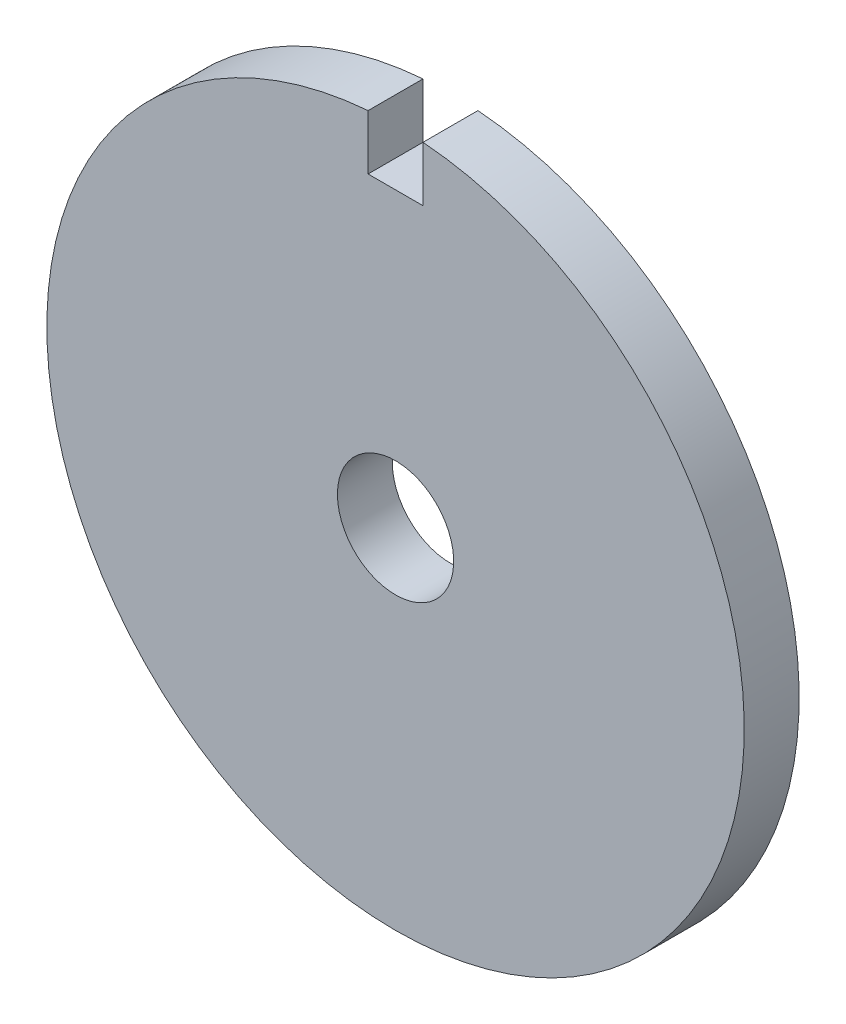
ISO-10303-21;
HEADER;
FILE_DESCRIPTION(('STEP AP214'),'2;1');
FILE_NAME('part.step','',(''),(''),'','','');
FILE_SCHEMA(('AUTOMOTIVE_DESIGN { 1 0 10303 214 1 1 1 1 }'));
ENDSEC;
DATA;
#1=APPLICATION_CONTEXT('core data for automotive mechanical design processes');
#2=APPLICATION_PROTOCOL_DEFINITION('international standard','automotive_design',2000,#1);
#3=PRODUCT_CONTEXT('',#1,'mechanical');
#4=PRODUCT('Part','Part','',(#3));
#5=PRODUCT_RELATED_PRODUCT_CATEGORY('part','',(#4));
#6=PRODUCT_DEFINITION_FORMATION('','',#4);
#7=PRODUCT_DEFINITION_CONTEXT('part definition',#1,'design');
#8=PRODUCT_DEFINITION('design','',#6,#7);
#9=PRODUCT_DEFINITION_SHAPE('','',#8);
#10=(LENGTH_UNIT() NAMED_UNIT(*) SI_UNIT(.MILLI.,.METRE.));
#11=(NAMED_UNIT(*) PLANE_ANGLE_UNIT() SI_UNIT($,.RADIAN.));
#12=(NAMED_UNIT(*) SI_UNIT($,.STERADIAN.) SOLID_ANGLE_UNIT());
#13=UNCERTAINTY_MEASURE_WITH_UNIT(LENGTH_MEASURE(1.E-05),#10,'distance_accuracy_value','');
#14=(GEOMETRIC_REPRESENTATION_CONTEXT(3) GLOBAL_UNCERTAINTY_ASSIGNED_CONTEXT((#13)) GLOBAL_UNIT_ASSIGNED_CONTEXT((#10,
#11,#12)) REPRESENTATION_CONTEXT('',''));
#15=CARTESIAN_POINT('',(0.,0.,0.));
#16=DIRECTION('',(0.,0.,1.));
#17=DIRECTION('',(1.,0.,0.));
#18=AXIS2_PLACEMENT_3D('',#15,#16,#17);
#19=CARTESIAN_POINT('',(0.,0.,2.99974));
#20=DIRECTION('',(0.,0.,1.));
#21=DIRECTION('',(1.,0.,0.));
#22=AXIS2_PLACEMENT_3D('',#19,#20,#21);
#23=PLANE('',#22);
#24=CARTESIAN_POINT('',(0.,0.,2.99974));
#25=DIRECTION('',(0.,0.,1.));
#26=DIRECTION('',(1.,0.,0.));
#27=AXIS2_PLACEMENT_3D('',#24,#25,#26);
#28=CIRCLE('',#27,3.175);
#29=CARTESIAN_POINT('',(-3.175,0.,2.99974));
#30=VERTEX_POINT('',#29);
#31=EDGE_CURVE('E58',#30,#30,#28,.T.);
#32=ORIENTED_EDGE('',*,*,#31,.F.);
#33=EDGE_LOOP('',(#32));
#34=FACE_BOUND('',#33,.T.);
#35=DIRECTION('',(-1.,0.,0.));
#36=VECTOR('',#35,1.);
#37=CARTESIAN_POINT('',(0.,15.990852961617,2.99974));
#38=LINE('',#37,#36);
#39=CARTESIAN_POINT('',(1.500000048,15.990852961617,2.99974));
#40=VERTEX_POINT('',#39);
#41=CARTESIAN_POINT('',(-1.500000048,15.990852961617,2.99974));
#42=VERTEX_POINT('',#41);
#43=EDGE_CURVE('E102',#40,#42,#38,.T.);
#44=ORIENTED_EDGE('',*,*,#43,.T.);
#45=DIRECTION('',(0.,-1.,0.));
#46=VECTOR('',#45,1.);
#47=CARTESIAN_POINT('',(-1.500000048,0.,2.99974));
#48=LINE('',#47,#46);
#49=CARTESIAN_POINT('',(-1.50000004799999,18.990853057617,2.99974));
#50=VERTEX_POINT('',#49);
#51=EDGE_CURVE('E93',#50,#42,#48,.T.);
#52=ORIENTED_EDGE('',*,*,#51,.F.);
#53=CARTESIAN_POINT('',(0.,0.,2.99974));
#54=DIRECTION('',(0.,0.,1.));
#55=DIRECTION('',(1.,0.,0.));
#56=AXIS2_PLACEMENT_3D('',#53,#54,#55);
#57=CIRCLE('',#56,19.05);
#58=CARTESIAN_POINT('',(1.500000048,18.990853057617,2.99974));
#59=VERTEX_POINT('',#58);
#60=EDGE_CURVE('E107',#50,#59,#57,.T.);
#61=ORIENTED_EDGE('',*,*,#60,.T.);
#62=DIRECTION('',(0.,-1.,0.));
#63=VECTOR('',#62,1.);
#64=CARTESIAN_POINT('',(1.500000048,0.,2.99974));
#65=LINE('',#64,#63);
#66=EDGE_CURVE('E65',#59,#40,#65,.T.);
#67=ORIENTED_EDGE('',*,*,#66,.T.);
#68=EDGE_LOOP('',(#44,#52,#61,#67));
#69=FACE_BOUND('',#68,.T.);
#70=ADVANCED_FACE('F49',(#34,#69),#23,.T.);
#71=CARTESIAN_POINT('',(0.,0.,0.));
#72=DIRECTION('',(0.,0.,1.));
#73=DIRECTION('',(1.,0.,0.));
#74=AXIS2_PLACEMENT_3D('',#71,#72,#73);
#75=PLANE('',#74);
#76=CARTESIAN_POINT('',(0.,0.,0.));
#77=DIRECTION('',(0.,0.,1.));
#78=DIRECTION('',(1.,0.,0.));
#79=AXIS2_PLACEMENT_3D('',#76,#77,#78);
#80=CIRCLE('',#79,3.175);
#81=CARTESIAN_POINT('',(-3.175,0.,0.));
#82=VERTEX_POINT('',#81);
#83=EDGE_CURVE('E113',#82,#82,#80,.T.);
#84=ORIENTED_EDGE('',*,*,#83,.T.);
#85=EDGE_LOOP('',(#84));
#86=FACE_BOUND('',#85,.T.);
#87=DIRECTION('',(0.,1.,0.));
#88=VECTOR('',#87,1.);
#89=CARTESIAN_POINT('',(-1.500000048,0.,0.));
#90=LINE('',#89,#88);
#91=CARTESIAN_POINT('',(-1.500000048,15.990852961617,0.));
#92=VERTEX_POINT('',#91);
#93=CARTESIAN_POINT('',(-1.50000004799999,18.990853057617,0.));
#94=VERTEX_POINT('',#93);
#95=EDGE_CURVE('E95',#92,#94,#90,.T.);
#96=ORIENTED_EDGE('',*,*,#95,.F.);
#97=DIRECTION('',(1.,0.,0.));
#98=VECTOR('',#97,1.);
#99=CARTESIAN_POINT('',(0.,15.990852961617,0.));
#100=LINE('',#99,#98);
#101=CARTESIAN_POINT('',(1.500000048,15.990852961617,0.));
#102=VERTEX_POINT('',#101);
#103=EDGE_CURVE('E11',#92,#102,#100,.T.);
#104=ORIENTED_EDGE('',*,*,#103,.T.);
#105=DIRECTION('',(0.,1.,0.));
#106=VECTOR('',#105,1.);
#107=CARTESIAN_POINT('',(1.500000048,0.,0.));
#108=LINE('',#107,#106);
#109=CARTESIAN_POINT('',(1.50000004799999,18.990853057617,0.));
#110=VERTEX_POINT('',#109);
#111=EDGE_CURVE('E158',#102,#110,#108,.T.);
#112=ORIENTED_EDGE('',*,*,#111,.T.);
#113=CARTESIAN_POINT('',(0.,0.,0.));
#114=DIRECTION('',(0.,0.,1.));
#115=DIRECTION('',(1.,0.,0.));
#116=AXIS2_PLACEMENT_3D('',#113,#114,#115);
#117=CIRCLE('',#116,19.05);
#118=EDGE_CURVE('E114',#94,#110,#117,.T.);
#119=ORIENTED_EDGE('',*,*,#118,.F.);
#120=EDGE_LOOP('',(#96,#104,#112,#119));
#121=FACE_BOUND('',#120,.T.);
#122=ADVANCED_FACE('F137',(#86,#121),#75,.F.);
#123=CARTESIAN_POINT('',(0.,0.,56.8812767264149));
#124=DIRECTION('',(0.,0.,-1.));
#125=DIRECTION('',(-1.,0.,0.));
#126=AXIS2_PLACEMENT_3D('',#123,#124,#125);
#127=CYLINDRICAL_SURFACE('',#126,19.05);
#128=DIRECTION('',(0.,0.,-1.));
#129=VECTOR('',#128,1.);
#130=CARTESIAN_POINT('',(-1.50000004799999,18.990853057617,2.99974));
#131=LINE('',#130,#129);
#132=EDGE_CURVE('E90',#50,#94,#131,.T.);
#133=ORIENTED_EDGE('',*,*,#132,.T.);
#134=ORIENTED_EDGE('',*,*,#118,.T.);
#135=DIRECTION('',(0.,0.,-1.));
#136=VECTOR('',#135,1.);
#137=CARTESIAN_POINT('',(1.50000004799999,18.990853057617,2.99974));
#138=LINE('',#137,#136);
#139=EDGE_CURVE('E101',#59,#110,#138,.T.);
#140=ORIENTED_EDGE('',*,*,#139,.F.);
#141=ORIENTED_EDGE('',*,*,#60,.F.);
#142=EDGE_LOOP('',(#133,#134,#140,#141));
#143=FACE_BOUND('',#142,.T.);
#144=ADVANCED_FACE('F111',(#143),#127,.T.);
#145=CARTESIAN_POINT('',(0.,0.,2.99974));
#146=DIRECTION('',(0.,0.,-1.));
#147=DIRECTION('',(-1.,0.,0.));
#148=AXIS2_PLACEMENT_3D('',#145,#146,#147);
#149=CYLINDRICAL_SURFACE('',#148,3.175);
#150=CARTESIAN_POINT('',(-3.175,0.,2.99974));
#151=CARTESIAN_POINT('',(-3.175,0.,2.96849270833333));
#152=CARTESIAN_POINT('',(-3.175,0.,2.93724541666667));
#153=CARTESIAN_POINT('',(-3.175,0.,2.87475083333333));
#154=CARTESIAN_POINT('',(-3.175,0.,2.84350354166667));
#155=CARTESIAN_POINT('',(-3.175,0.,2.78100895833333));
#156=CARTESIAN_POINT('',(-3.175,0.,2.74976166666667));
#157=CARTESIAN_POINT('',(-3.175,0.,2.68726708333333));
#158=CARTESIAN_POINT('',(-3.175,0.,2.65601979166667));
#159=CARTESIAN_POINT('',(-3.175,0.,2.59352520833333));
#160=CARTESIAN_POINT('',(-3.175,0.,2.56227791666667));
#161=CARTESIAN_POINT('',(-3.175,0.,2.49978333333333));
#162=CARTESIAN_POINT('',(-3.175,0.,2.46853604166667));
#163=CARTESIAN_POINT('',(-3.175,0.,2.40604145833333));
#164=CARTESIAN_POINT('',(-3.175,0.,2.37479416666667));
#165=CARTESIAN_POINT('',(-3.175,0.,2.31229958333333));
#166=CARTESIAN_POINT('',(-3.175,0.,2.28105229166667));
#167=CARTESIAN_POINT('',(-3.175,0.,2.21855770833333));
#168=CARTESIAN_POINT('',(-3.175,0.,2.18731041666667));
#169=CARTESIAN_POINT('',(-3.175,0.,2.12481583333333));
#170=CARTESIAN_POINT('',(-3.175,0.,2.09356854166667));
#171=CARTESIAN_POINT('',(-3.175,0.,2.03107395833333));
#172=CARTESIAN_POINT('',(-3.175,0.,1.99982666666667));
#173=CARTESIAN_POINT('',(-3.175,0.,1.93733208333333));
#174=CARTESIAN_POINT('',(-3.175,0.,1.90608479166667));
#175=CARTESIAN_POINT('',(-3.175,0.,1.84359020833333));
#176=CARTESIAN_POINT('',(-3.175,0.,1.81234291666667));
#177=CARTESIAN_POINT('',(-3.175,0.,1.74984833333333));
#178=CARTESIAN_POINT('',(-3.175,0.,1.71860104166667));
#179=CARTESIAN_POINT('',(-3.175,0.,1.65610645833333));
#180=CARTESIAN_POINT('',(-3.175,0.,1.62485916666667));
#181=CARTESIAN_POINT('',(-3.175,0.,1.56236458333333));
#182=CARTESIAN_POINT('',(-3.175,0.,1.53111729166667));
#183=CARTESIAN_POINT('',(-3.175,0.,1.46862270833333));
#184=CARTESIAN_POINT('',(-3.175,0.,1.43737541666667));
#185=CARTESIAN_POINT('',(-3.175,0.,1.37488083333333));
#186=CARTESIAN_POINT('',(-3.175,0.,1.34363354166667));
#187=CARTESIAN_POINT('',(-3.175,0.,1.28113895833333));
#188=CARTESIAN_POINT('',(-3.175,0.,1.24989166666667));
#189=CARTESIAN_POINT('',(-3.175,0.,1.18739708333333));
#190=CARTESIAN_POINT('',(-3.175,0.,1.15614979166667));
#191=CARTESIAN_POINT('',(-3.175,0.,1.09365520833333));
#192=CARTESIAN_POINT('',(-3.175,0.,1.06240791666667));
#193=CARTESIAN_POINT('',(-3.175,0.,0.999913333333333));
#194=CARTESIAN_POINT('',(-3.175,0.,0.968666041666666));
#195=CARTESIAN_POINT('',(-3.175,0.,0.906171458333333));
#196=CARTESIAN_POINT('',(-3.175,0.,0.874924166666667));
#197=CARTESIAN_POINT('',(-3.175,0.,0.812429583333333));
#198=CARTESIAN_POINT('',(-3.175,0.,0.781182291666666));
#199=CARTESIAN_POINT('',(-3.175,0.,0.718687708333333));
#200=CARTESIAN_POINT('',(-3.175,0.,0.687440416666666));
#201=CARTESIAN_POINT('',(-3.175,0.,0.624945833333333));
#202=CARTESIAN_POINT('',(-3.175,0.,0.593698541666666));
#203=CARTESIAN_POINT('',(-3.175,0.,0.531203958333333));
#204=CARTESIAN_POINT('',(-3.175,0.,0.499956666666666));
#205=CARTESIAN_POINT('',(-3.175,0.,0.437462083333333));
#206=CARTESIAN_POINT('',(-3.175,0.,0.406214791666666));
#207=CARTESIAN_POINT('',(-3.175,0.,0.343720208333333));
#208=CARTESIAN_POINT('',(-3.175,0.,0.312472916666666));
#209=CARTESIAN_POINT('',(-3.175,0.,0.249978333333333));
#210=CARTESIAN_POINT('',(-3.175,0.,0.218731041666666));
#211=CARTESIAN_POINT('',(-3.175,0.,0.156236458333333));
#212=CARTESIAN_POINT('',(-3.175,0.,0.124989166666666));
#213=CARTESIAN_POINT('',(-3.175,0.,0.0624945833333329));
#214=CARTESIAN_POINT('',(-3.175,0.,0.0312472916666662));
#215=CARTESIAN_POINT('',(-3.175,0.,0.));
#216=B_SPLINE_CURVE_WITH_KNOTS('',3,(#150,#151,#152,#153,#154,#155,#156,#157,#158,#159,#160,
#161,#162,#163,#164,#165,#166,#167,#168,#169,#170,#171,#172,#173,#174,#175,#176,#177,#178,#179,
#180,#181,#182,#183,#184,#185,#186,#187,#188,#189,#190,#191,#192,#193,#194,#195,#196,#197,#198,
#199,#200,#201,#202,#203,#204,#205,#206,#207,#208,#209,#210,#211,#212,#213,#214,#215),
.UNSPECIFIED.,.F.,.F.,(4,2,2,2,2,2,2,2,2,2,2,2,2,2,2,2,2,2,2,2,2,2,2,2,2,2,2,2,2,2,2,2,4),(0.,
0.0937418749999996,0.18748375,0.281225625,0.3749675,0.468709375,0.56245125,0.656193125,0.749935,
0.843676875,0.93741875,1.031160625,1.1249025,1.218644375,1.31238625,1.406128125,1.49987,
1.593611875,1.68735375,1.781095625,1.8748375,1.968579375,2.06232125,2.156063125,2.249805,
2.343546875,2.43728875,2.531030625,2.6247725,2.718514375,2.81225625,2.905998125,2.99974),.UNSPECIFIED.);
#217=EDGE_CURVE('BSEAM51',#30,#82,#216,.T.);
#218=ORIENTED_EDGE('',*,*,#31,.T.);
#219=ORIENTED_EDGE('',*,*,#83,.F.);
#220=ORIENTED_EDGE('',*,*,#217,.T.);
#221=ORIENTED_EDGE('',*,*,#217,.F.);
#222=EDGE_LOOP('',(#218,#220,#219,#221));
#223=FACE_BOUND('',#222,.T.);
#224=ADVANCED_FACE('F51',(#223),#149,.F.);
#225=CARTESIAN_POINT('',(0.,15.990852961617,2.99974));
#226=DIRECTION('',(0.,-1.,0.));
#227=DIRECTION('',(0.,0.,-1.));
#228=AXIS2_PLACEMENT_3D('',#225,#226,#227);
#229=PLANE('',#228);
#230=DIRECTION('',(0.,0.,-1.));
#231=VECTOR('',#230,1.);
#232=CARTESIAN_POINT('',(-1.500000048,15.990852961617,2.99974));
#233=LINE('',#232,#231);
#234=EDGE_CURVE('E156',#42,#92,#233,.T.);
#235=ORIENTED_EDGE('',*,*,#234,.F.);
#236=ORIENTED_EDGE('',*,*,#43,.F.);
#237=DIRECTION('',(0.,0.,-1.));
#238=VECTOR('',#237,1.);
#239=CARTESIAN_POINT('',(1.500000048,15.990852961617,2.99974));
#240=LINE('',#239,#238);
#241=EDGE_CURVE('E159',#40,#102,#240,.T.);
#242=ORIENTED_EDGE('',*,*,#241,.T.);
#243=ORIENTED_EDGE('',*,*,#103,.F.);
#244=EDGE_LOOP('',(#235,#236,#242,#243));
#245=FACE_BOUND('',#244,.T.);
#246=ADVANCED_FACE('F150',(#245),#229,.F.);
#247=CARTESIAN_POINT('',(-1.500000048,0.,2.99974));
#248=DIRECTION('',(1.,0.,0.));
#249=DIRECTION('',(0.,1.,0.));
#250=AXIS2_PLACEMENT_3D('',#247,#248,#249);
#251=PLANE('',#250);
#252=ORIENTED_EDGE('',*,*,#95,.T.);
#253=ORIENTED_EDGE('',*,*,#132,.F.);
#254=ORIENTED_EDGE('',*,*,#51,.T.);
#255=ORIENTED_EDGE('',*,*,#234,.T.);
#256=EDGE_LOOP('',(#252,#253,#254,#255));
#257=FACE_BOUND('',#256,.T.);
#258=ADVANCED_FACE('F92',(#257),#251,.T.);
#259=CARTESIAN_POINT('',(1.500000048,0.,2.99974));
#260=DIRECTION('',(1.,0.,0.));
#261=DIRECTION('',(0.,1.,0.));
#262=AXIS2_PLACEMENT_3D('',#259,#260,#261);
#263=PLANE('',#262);
#264=ORIENTED_EDGE('',*,*,#241,.F.);
#265=ORIENTED_EDGE('',*,*,#66,.F.);
#266=ORIENTED_EDGE('',*,*,#139,.T.);
#267=ORIENTED_EDGE('',*,*,#111,.F.);
#268=EDGE_LOOP('',(#264,#265,#266,#267));
#269=FACE_BOUND('',#268,.T.);
#270=ADVANCED_FACE('F149',(#269),#263,.F.);
#271=CLOSED_SHELL('',(#70,#122,#144,#224,#246,#258,#270));
#272=MANIFOLD_SOLID_BREP('B2',#271);
#273=ADVANCED_BREP_SHAPE_REPRESENTATION('',(#18,#272),#14);
#274=SHAPE_DEFINITION_REPRESENTATION(#9,#273);
ENDSEC;
END-ISO-10303-21;
